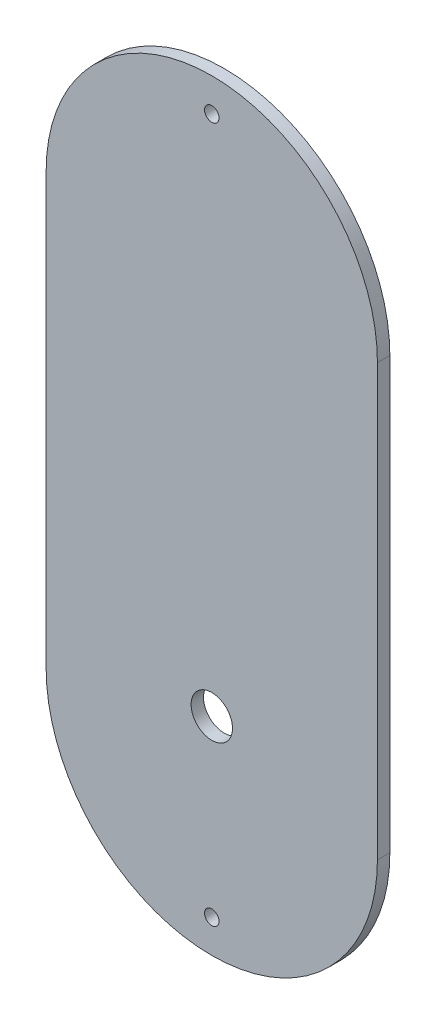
ISO-10303-21;
HEADER;
FILE_DESCRIPTION(('STEP AP214'),'2;1');
FILE_NAME('part.step','',(''),(''),'','','');
FILE_SCHEMA(('AUTOMOTIVE_DESIGN { 1 0 10303 214 1 1 1 1 }'));
ENDSEC;
DATA;
#1=APPLICATION_CONTEXT('core data for automotive mechanical design processes');
#2=APPLICATION_PROTOCOL_DEFINITION('international standard','automotive_design',2000,#1);
#3=PRODUCT_CONTEXT('',#1,'mechanical');
#4=PRODUCT('Part','Part','',(#3));
#5=PRODUCT_RELATED_PRODUCT_CATEGORY('part','',(#4));
#6=PRODUCT_DEFINITION_FORMATION('','',#4);
#7=PRODUCT_DEFINITION_CONTEXT('part definition',#1,'design');
#8=PRODUCT_DEFINITION('design','',#6,#7);
#9=PRODUCT_DEFINITION_SHAPE('','',#8);
#10=(LENGTH_UNIT() NAMED_UNIT(*) SI_UNIT(.MILLI.,.METRE.));
#11=(NAMED_UNIT(*) PLANE_ANGLE_UNIT() SI_UNIT($,.RADIAN.));
#12=(NAMED_UNIT(*) SI_UNIT($,.STERADIAN.) SOLID_ANGLE_UNIT());
#13=UNCERTAINTY_MEASURE_WITH_UNIT(LENGTH_MEASURE(1.E-05),#10,'distance_accuracy_value','');
#14=(GEOMETRIC_REPRESENTATION_CONTEXT(3) GLOBAL_UNCERTAINTY_ASSIGNED_CONTEXT((#13)) GLOBAL_UNIT_ASSIGNED_CONTEXT((#10,
#11,#12)) REPRESENTATION_CONTEXT('',''));
#15=CARTESIAN_POINT('',(0.,0.,0.));
#16=DIRECTION('',(0.,0.,1.));
#17=DIRECTION('',(1.,0.,0.));
#18=AXIS2_PLACEMENT_3D('',#15,#16,#17);
#19=CARTESIAN_POINT('',(0.,104.,3.));
#20=DIRECTION('',(0.,0.,1.));
#21=DIRECTION('',(1.,0.,0.));
#22=AXIS2_PLACEMENT_3D('',#19,#20,#21);
#23=PLANE('',#22);
#24=CARTESIAN_POINT('',(0.,10.,3.));
#25=DIRECTION('',(0.,0.,1.));
#26=DIRECTION('',(1.,0.,0.));
#27=AXIS2_PLACEMENT_3D('',#24,#25,#26);
#28=CIRCLE('',#27,5.);
#29=CARTESIAN_POINT('',(5.,10.,3.));
#30=VERTEX_POINT('',#29);
#31=EDGE_CURVE('E122',#30,#30,#28,.T.);
#32=ORIENTED_EDGE('',*,*,#31,.F.);
#33=EDGE_LOOP('',(#32));
#34=FACE_BOUND('',#33,.T.);
#35=CARTESIAN_POINT('',(0.,104.,3.));
#36=DIRECTION('',(0.,0.,1.));
#37=DIRECTION('',(1.,0.,0.));
#38=AXIS2_PLACEMENT_3D('',#35,#36,#37);
#39=CIRCLE('',#38,40.);
#40=CARTESIAN_POINT('',(40.,104.,3.));
#41=VERTEX_POINT('',#40);
#42=CARTESIAN_POINT('',(-40.,104.,3.));
#43=VERTEX_POINT('',#42);
#44=EDGE_CURVE('E92',#41,#43,#39,.T.);
#45=ORIENTED_EDGE('',*,*,#44,.T.);
#46=DIRECTION('',(0.,-1.,0.));
#47=VECTOR('',#46,1.);
#48=CARTESIAN_POINT('',(-40.,104.,3.));
#49=LINE('',#48,#47);
#50=CARTESIAN_POINT('',(-40.,0.,3.));
#51=VERTEX_POINT('',#50);
#52=EDGE_CURVE('E87',#43,#51,#49,.T.);
#53=ORIENTED_EDGE('',*,*,#52,.T.);
#54=CARTESIAN_POINT('',(0.,0.,3.));
#55=DIRECTION('',(0.,0.,1.));
#56=DIRECTION('',(1.,0.,0.));
#57=AXIS2_PLACEMENT_3D('',#54,#55,#56);
#58=CIRCLE('',#57,40.);
#59=CARTESIAN_POINT('',(40.,0.,3.));
#60=VERTEX_POINT('',#59);
#61=EDGE_CURVE('E90',#51,#60,#58,.T.);
#62=ORIENTED_EDGE('',*,*,#61,.T.);
#63=DIRECTION('',(0.,1.,0.));
#64=VECTOR('',#63,1.);
#65=CARTESIAN_POINT('',(40.,104.,3.));
#66=LINE('',#65,#64);
#67=EDGE_CURVE('E57',#60,#41,#66,.T.);
#68=ORIENTED_EDGE('',*,*,#67,.T.);
#69=EDGE_LOOP('',(#45,#53,#62,#68));
#70=FACE_BOUND('',#69,.T.);
#71=CARTESIAN_POINT('',(0.,-32.,3.));
#72=DIRECTION('',(0.,0.,1.));
#73=DIRECTION('',(1.,0.,0.));
#74=AXIS2_PLACEMENT_3D('',#71,#72,#73);
#75=CIRCLE('',#74,1.75);
#76=CARTESIAN_POINT('',(1.75,-32.,3.));
#77=VERTEX_POINT('',#76);
#78=EDGE_CURVE('E107',#77,#77,#75,.T.);
#79=ORIENTED_EDGE('',*,*,#78,.F.);
#80=EDGE_LOOP('',(#79));
#81=FACE_BOUND('',#80,.T.);
#82=CARTESIAN_POINT('',(0.,136.,3.));
#83=DIRECTION('',(0.,0.,1.));
#84=DIRECTION('',(1.,0.,0.));
#85=AXIS2_PLACEMENT_3D('',#82,#83,#84);
#86=CIRCLE('',#85,1.75);
#87=CARTESIAN_POINT('',(1.75,136.,3.));
#88=VERTEX_POINT('',#87);
#89=EDGE_CURVE('E128',#88,#88,#86,.T.);
#90=ORIENTED_EDGE('',*,*,#89,.F.);
#91=EDGE_LOOP('',(#90));
#92=FACE_BOUND('',#91,.T.);
#93=ADVANCED_FACE('F40',(#34,#70,#81,#92),#23,.T.);
#94=CARTESIAN_POINT('',(0.,104.,0.));
#95=DIRECTION('',(0.,0.,1.));
#96=DIRECTION('',(1.,0.,0.));
#97=AXIS2_PLACEMENT_3D('',#94,#95,#96);
#98=PLANE('',#97);
#99=CARTESIAN_POINT('',(0.,10.,0.));
#100=DIRECTION('',(0.,0.,1.));
#101=DIRECTION('',(1.,0.,0.));
#102=AXIS2_PLACEMENT_3D('',#99,#100,#101);
#103=CIRCLE('',#102,5.);
#104=CARTESIAN_POINT('',(5.,10.,0.));
#105=VERTEX_POINT('',#104);
#106=EDGE_CURVE('E125',#105,#105,#103,.T.);
#107=ORIENTED_EDGE('',*,*,#106,.T.);
#108=EDGE_LOOP('',(#107));
#109=FACE_BOUND('',#108,.T.);
#110=CARTESIAN_POINT('',(0.,104.,0.));
#111=DIRECTION('',(0.,0.,1.));
#112=DIRECTION('',(1.,0.,0.));
#113=AXIS2_PLACEMENT_3D('',#110,#111,#112);
#114=CIRCLE('',#113,40.);
#115=CARTESIAN_POINT('',(40.,104.,0.));
#116=VERTEX_POINT('',#115);
#117=CARTESIAN_POINT('',(-40.,104.,0.));
#118=VERTEX_POINT('',#117);
#119=EDGE_CURVE('E104',#116,#118,#114,.T.);
#120=ORIENTED_EDGE('',*,*,#119,.F.);
#121=DIRECTION('',(0.,1.,0.));
#122=VECTOR('',#121,1.);
#123=CARTESIAN_POINT('',(40.,104.,0.));
#124=LINE('',#123,#122);
#125=CARTESIAN_POINT('',(40.,0.,0.));
#126=VERTEX_POINT('',#125);
#127=EDGE_CURVE('E80',#126,#116,#124,.T.);
#128=ORIENTED_EDGE('',*,*,#127,.F.);
#129=CARTESIAN_POINT('',(0.,0.,0.));
#130=DIRECTION('',(0.,0.,1.));
#131=DIRECTION('',(1.,0.,0.));
#132=AXIS2_PLACEMENT_3D('',#129,#130,#131);
#133=CIRCLE('',#132,40.);
#134=CARTESIAN_POINT('',(-40.,0.,0.));
#135=VERTEX_POINT('',#134);
#136=EDGE_CURVE('E74',#135,#126,#133,.T.);
#137=ORIENTED_EDGE('',*,*,#136,.F.);
#138=DIRECTION('',(0.,-1.,0.));
#139=VECTOR('',#138,1.);
#140=CARTESIAN_POINT('',(-40.,104.,0.));
#141=LINE('',#140,#139);
#142=EDGE_CURVE('E96',#118,#135,#141,.T.);
#143=ORIENTED_EDGE('',*,*,#142,.F.);
#144=EDGE_LOOP('',(#120,#128,#137,#143));
#145=FACE_BOUND('',#144,.T.);
#146=CARTESIAN_POINT('',(0.,-32.,0.));
#147=DIRECTION('',(0.,0.,1.));
#148=DIRECTION('',(1.,0.,0.));
#149=AXIS2_PLACEMENT_3D('',#146,#147,#148);
#150=CIRCLE('',#149,1.75);
#151=CARTESIAN_POINT('',(1.75,-32.,0.));
#152=VERTEX_POINT('',#151);
#153=EDGE_CURVE('E119',#152,#152,#150,.T.);
#154=ORIENTED_EDGE('',*,*,#153,.T.);
#155=EDGE_LOOP('',(#154));
#156=FACE_BOUND('',#155,.T.);
#157=CARTESIAN_POINT('',(0.,136.,0.));
#158=DIRECTION('',(0.,0.,1.));
#159=DIRECTION('',(1.,0.,0.));
#160=AXIS2_PLACEMENT_3D('',#157,#158,#159);
#161=CIRCLE('',#160,1.75);
#162=CARTESIAN_POINT('',(1.75,136.,0.));
#163=VERTEX_POINT('',#162);
#164=EDGE_CURVE('E131',#163,#163,#161,.T.);
#165=ORIENTED_EDGE('',*,*,#164,.T.);
#166=EDGE_LOOP('',(#165));
#167=FACE_BOUND('',#166,.T.);
#168=ADVANCED_FACE('F115',(#109,#145,#156,#167),#98,.F.);
#169=CARTESIAN_POINT('',(0.,104.,3.));
#170=DIRECTION('',(0.,0.,-1.));
#171=DIRECTION('',(-1.,0.,0.));
#172=AXIS2_PLACEMENT_3D('',#169,#170,#171);
#173=CYLINDRICAL_SURFACE('',#172,40.);
#174=ORIENTED_EDGE('',*,*,#119,.T.);
#175=DIRECTION('',(0.,0.,-1.));
#176=VECTOR('',#175,1.);
#177=CARTESIAN_POINT('',(-40.,104.,3.));
#178=LINE('',#177,#176);
#179=EDGE_CURVE('E13',#43,#118,#178,.T.);
#180=ORIENTED_EDGE('',*,*,#179,.F.);
#181=ORIENTED_EDGE('',*,*,#44,.F.);
#182=DIRECTION('',(0.,0.,-1.));
#183=VECTOR('',#182,1.);
#184=CARTESIAN_POINT('',(40.,104.,3.));
#185=LINE('',#184,#183);
#186=EDGE_CURVE('E100',#41,#116,#185,.T.);
#187=ORIENTED_EDGE('',*,*,#186,.T.);
#188=EDGE_LOOP('',(#174,#180,#181,#187));
#189=FACE_BOUND('',#188,.T.);
#190=ADVANCED_FACE('F42',(#189),#173,.T.);
#191=CARTESIAN_POINT('',(-40.,104.,3.));
#192=DIRECTION('',(1.,0.,0.));
#193=DIRECTION('',(0.,1.,0.));
#194=AXIS2_PLACEMENT_3D('',#191,#192,#193);
#195=PLANE('',#194);
#196=ORIENTED_EDGE('',*,*,#142,.T.);
#197=DIRECTION('',(0.,0.,-1.));
#198=VECTOR('',#197,1.);
#199=CARTESIAN_POINT('',(-40.,0.,3.));
#200=LINE('',#199,#198);
#201=EDGE_CURVE('E49',#51,#135,#200,.T.);
#202=ORIENTED_EDGE('',*,*,#201,.F.);
#203=ORIENTED_EDGE('',*,*,#52,.F.);
#204=ORIENTED_EDGE('',*,*,#179,.T.);
#205=EDGE_LOOP('',(#196,#202,#203,#204));
#206=FACE_BOUND('',#205,.T.);
#207=ADVANCED_FACE('F95',(#206),#195,.F.);
#208=CARTESIAN_POINT('',(0.,0.,3.));
#209=DIRECTION('',(0.,0.,-1.));
#210=DIRECTION('',(-1.,0.,0.));
#211=AXIS2_PLACEMENT_3D('',#208,#209,#210);
#212=CYLINDRICAL_SURFACE('',#211,40.);
#213=ORIENTED_EDGE('',*,*,#136,.T.);
#214=DIRECTION('',(0.,0.,-1.));
#215=VECTOR('',#214,1.);
#216=CARTESIAN_POINT('',(40.,0.,3.));
#217=LINE('',#216,#215);
#218=EDGE_CURVE('E97',#60,#126,#217,.T.);
#219=ORIENTED_EDGE('',*,*,#218,.F.);
#220=ORIENTED_EDGE('',*,*,#61,.F.);
#221=ORIENTED_EDGE('',*,*,#201,.T.);
#222=EDGE_LOOP('',(#213,#219,#220,#221));
#223=FACE_BOUND('',#222,.T.);
#224=ADVANCED_FACE('F98',(#223),#212,.T.);
#225=CARTESIAN_POINT('',(40.,104.,3.));
#226=DIRECTION('',(-1.,0.,0.));
#227=DIRECTION('',(0.,-1.,0.));
#228=AXIS2_PLACEMENT_3D('',#225,#226,#227);
#229=PLANE('',#228);
#230=ORIENTED_EDGE('',*,*,#127,.T.);
#231=ORIENTED_EDGE('',*,*,#186,.F.);
#232=ORIENTED_EDGE('',*,*,#67,.F.);
#233=ORIENTED_EDGE('',*,*,#218,.T.);
#234=EDGE_LOOP('',(#230,#231,#232,#233));
#235=FACE_BOUND('',#234,.T.);
#236=ADVANCED_FACE('F112',(#235),#229,.F.);
#237=CARTESIAN_POINT('',(0.,-32.,3.));
#238=DIRECTION('',(0.,0.,-1.));
#239=DIRECTION('',(-1.,0.,0.));
#240=AXIS2_PLACEMENT_3D('',#237,#238,#239);
#241=CYLINDRICAL_SURFACE('',#240,1.75);
#242=ORIENTED_EDGE('',*,*,#78,.T.);
#243=EDGE_LOOP('',(#242));
#244=FACE_BOUND('',#243,.T.);
#245=ORIENTED_EDGE('',*,*,#153,.F.);
#246=EDGE_LOOP('',(#245));
#247=FACE_BOUND('',#246,.T.);
#248=ADVANCED_FACE('F150',(#244,#247),#241,.F.);
#249=CARTESIAN_POINT('',(0.,10.,3.));
#250=DIRECTION('',(0.,0.,-1.));
#251=DIRECTION('',(-1.,0.,0.));
#252=AXIS2_PLACEMENT_3D('',#249,#250,#251);
#253=CYLINDRICAL_SURFACE('',#252,5.);
#254=ORIENTED_EDGE('',*,*,#31,.T.);
#255=EDGE_LOOP('',(#254));
#256=FACE_BOUND('',#255,.T.);
#257=ORIENTED_EDGE('',*,*,#106,.F.);
#258=EDGE_LOOP('',(#257));
#259=FACE_BOUND('',#258,.T.);
#260=ADVANCED_FACE('F196',(#256,#259),#253,.F.);
#261=CARTESIAN_POINT('',(0.,136.,3.));
#262=DIRECTION('',(0.,0.,-1.));
#263=DIRECTION('',(-1.,0.,0.));
#264=AXIS2_PLACEMENT_3D('',#261,#262,#263);
#265=CYLINDRICAL_SURFACE('',#264,1.75);
#266=ORIENTED_EDGE('',*,*,#89,.T.);
#267=EDGE_LOOP('',(#266));
#268=FACE_BOUND('',#267,.T.);
#269=ORIENTED_EDGE('',*,*,#164,.F.);
#270=EDGE_LOOP('',(#269));
#271=FACE_BOUND('',#270,.T.);
#272=ADVANCED_FACE('F137',(#268,#271),#265,.F.);
#273=CLOSED_SHELL('',(#93,#168,#190,#207,#224,#236,#248,#260,#272));
#274=MANIFOLD_SOLID_BREP('B2',#273);
#275=ADVANCED_BREP_SHAPE_REPRESENTATION('',(#18,#274),#14);
#276=SHAPE_DEFINITION_REPRESENTATION(#9,#275);
ENDSEC;
END-ISO-10303-21;
